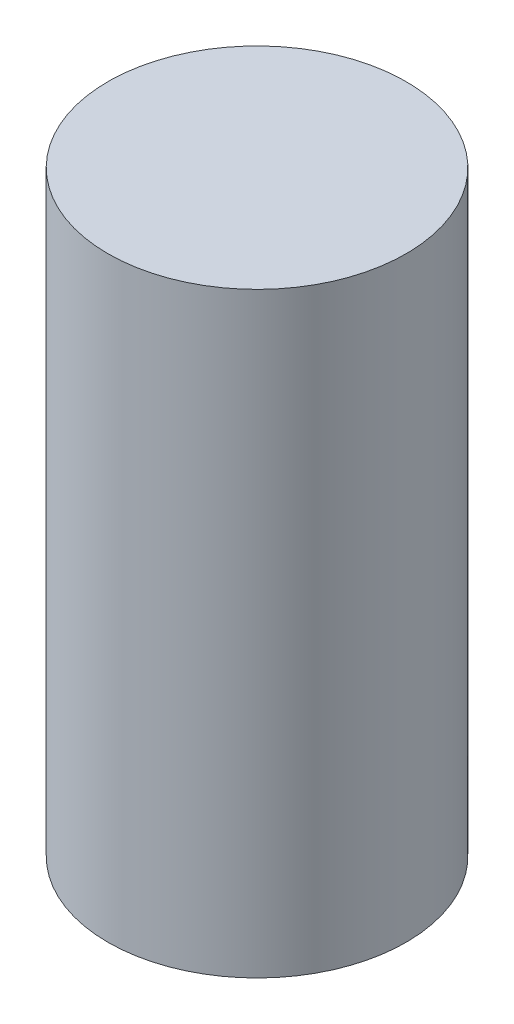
from build123d import *

# Parameters (mm, degrees)
CROQUIS1_R              = 2.5
SALIENTE_EXTRUIR1_DEPTH = 5


with BuildPart() as part:
    # Croquis1 → Saliente-Extruir1 (new, symmetric)
    with BuildSketch(Plane(origin=(0, 0, 0), x_dir=(1, 0, 0), z_dir=(0, 1, 0))):
        with Locations(Location((0, 0, 0), (0, 0, 270))):
            Circle(CROQUIS1_R)
    extrude(amount=SALIENTE_EXTRUIR1_DEPTH, both=True)


solid = part.part
